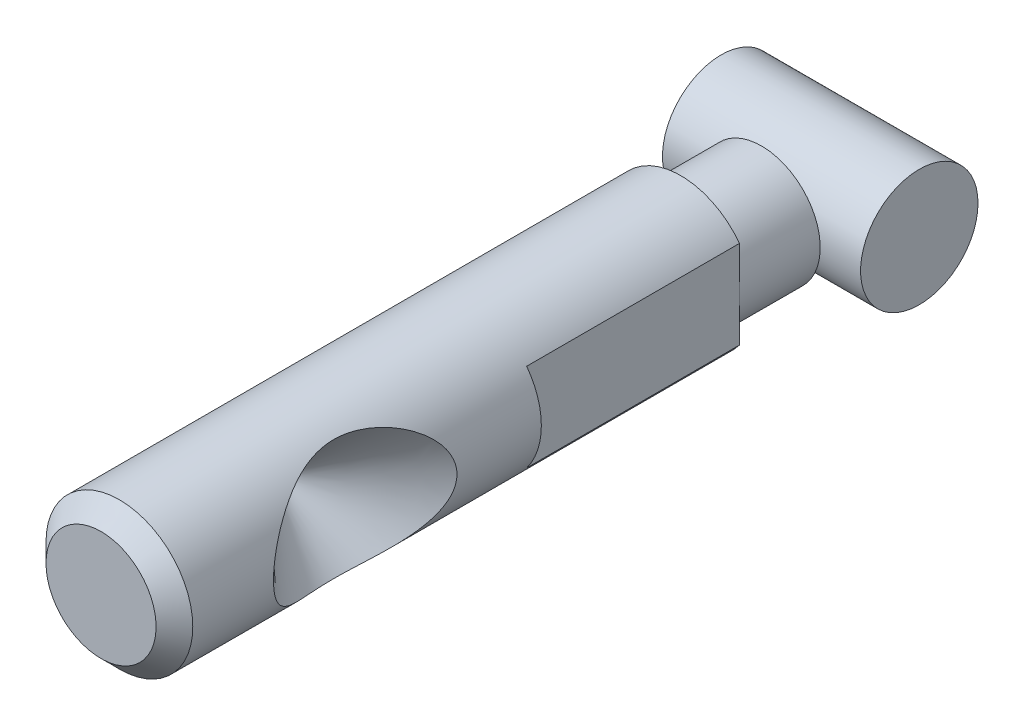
ISO-10303-21;
HEADER;
FILE_DESCRIPTION(('STEP AP214'),'2;1');
FILE_NAME('part.step','',(''),(''),'','','');
FILE_SCHEMA(('AUTOMOTIVE_DESIGN { 1 0 10303 214 1 1 1 1 }'));
ENDSEC;
DATA;
#1=APPLICATION_CONTEXT('core data for automotive mechanical design processes');
#2=APPLICATION_PROTOCOL_DEFINITION('international standard','automotive_design',2000,#1);
#3=PRODUCT_CONTEXT('',#1,'mechanical');
#4=PRODUCT('Part','Part','',(#3));
#5=PRODUCT_RELATED_PRODUCT_CATEGORY('part','',(#4));
#6=PRODUCT_DEFINITION_FORMATION('','',#4);
#7=PRODUCT_DEFINITION_CONTEXT('part definition',#1,'design');
#8=PRODUCT_DEFINITION('design','',#6,#7);
#9=PRODUCT_DEFINITION_SHAPE('','',#8);
#10=(LENGTH_UNIT() NAMED_UNIT(*) SI_UNIT(.MILLI.,.METRE.));
#11=(NAMED_UNIT(*) PLANE_ANGLE_UNIT() SI_UNIT($,.RADIAN.));
#12=(NAMED_UNIT(*) SI_UNIT($,.STERADIAN.) SOLID_ANGLE_UNIT());
#13=UNCERTAINTY_MEASURE_WITH_UNIT(LENGTH_MEASURE(1.E-05),#10,'distance_accuracy_value','');
#14=(GEOMETRIC_REPRESENTATION_CONTEXT(3) GLOBAL_UNCERTAINTY_ASSIGNED_CONTEXT((#13)) GLOBAL_UNIT_ASSIGNED_CONTEXT((#10,
#11,#12)) REPRESENTATION_CONTEXT('',''));
#15=CARTESIAN_POINT('',(0.,0.,0.));
#16=DIRECTION('',(0.,0.,1.));
#17=DIRECTION('',(1.,0.,0.));
#18=AXIS2_PLACEMENT_3D('',#15,#16,#17);
#19=CARTESIAN_POINT('',(-4.,3.,4.));
#20=DIRECTION('',(1.,0.,0.));
#21=DIRECTION('',(0.,0.,-1.));
#22=AXIS2_PLACEMENT_3D('',#19,#20,#21);
#23=PLANE('',#22);
#24=DIRECTION('',(0.,-1.,0.));
#25=VECTOR('',#24,1.);
#26=CARTESIAN_POINT('',(-4.,0.,9.5));
#27=LINE('',#26,#25);
#28=CARTESIAN_POINT('',(-4.,3.,9.5));
#29=VERTEX_POINT('',#28);
#30=CARTESIAN_POINT('',(-4.,0.,9.5));
#31=VERTEX_POINT('',#30);
#32=EDGE_CURVE('P0_E89',#29,#31,#27,.T.);
#33=ORIENTED_EDGE('',*,*,#32,.T.);
#34=DIRECTION('',(0.,1.,0.));
#35=VECTOR('',#34,1.);
#36=CARTESIAN_POINT('',(-4.,0.,9.5));
#37=LINE('',#36,#35);
#38=CARTESIAN_POINT('',(-4.,-3.,9.5));
#39=VERTEX_POINT('',#38);
#40=EDGE_CURVE('P0_E101',#39,#31,#37,.T.);
#41=ORIENTED_EDGE('',*,*,#40,.F.);
#42=DIRECTION('',(0.,0.,1.));
#43=VECTOR('',#42,1.);
#44=CARTESIAN_POINT('',(-4.,-3.,4.));
#45=LINE('',#44,#43);
#46=CARTESIAN_POINT('',(-4.,-3.,24.));
#47=VERTEX_POINT('',#46);
#48=EDGE_CURVE('P0_E11',#47,#39,#45,.F.);
#49=ORIENTED_EDGE('',*,*,#48,.F.);
#50=DIRECTION('',(0.,1.,0.));
#51=VECTOR('',#50,1.);
#52=CARTESIAN_POINT('',(-4.,3.,24.));
#53=LINE('',#52,#51);
#54=CARTESIAN_POINT('',(-4.,3.,24.));
#55=VERTEX_POINT('',#54);
#56=EDGE_CURVE('P0_E123',#55,#47,#53,.F.);
#57=ORIENTED_EDGE('',*,*,#56,.F.);
#58=DIRECTION('',(0.,0.,1.));
#59=VECTOR('',#58,1.);
#60=CARTESIAN_POINT('',(-4.,3.,4.));
#61=LINE('',#60,#59);
#62=EDGE_CURVE('P0_E103',#29,#55,#61,.T.);
#63=ORIENTED_EDGE('',*,*,#62,.F.);
#64=EDGE_LOOP('',(#33,#41,#49,#57,#63));
#65=FACE_BOUND('',#64,.T.);
#66=ADVANCED_FACE('P0_F35',(#65),#23,.F.);
#67=CARTESIAN_POINT('',(0.,0.,4.));
#68=DIRECTION('',(0.,0.,1.));
#69=DIRECTION('',(1.,0.,0.));
#70=AXIS2_PLACEMENT_3D('',#67,#68,#69);
#71=CYLINDRICAL_SURFACE('',#70,5.);
#72=CARTESIAN_POINT('',(5.,0.,42.25));
#73=CARTESIAN_POINT('',(4.99999995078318,0.0804821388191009,42.2499999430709));
#74=CARTESIAN_POINT('',(4.99805116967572,0.160970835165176,42.2464932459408));
#75=CARTESIAN_POINT('',(4.9903177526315,0.321197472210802,42.2325640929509));
#76=CARTESIAN_POINT('',(4.98453097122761,0.400934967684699,42.2221377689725));
#77=CARTESIAN_POINT('',(4.96928487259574,0.559039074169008,42.1946242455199));
#78=CARTESIAN_POINT('',(4.95981901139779,0.637402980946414,42.1775251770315));
#79=CARTESIAN_POINT('',(4.93749012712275,0.792027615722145,42.137100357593));
#80=CARTESIAN_POINT('',(4.92462530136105,0.868287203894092,42.1137713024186));
#81=CARTESIAN_POINT('',(4.88172535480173,1.09156138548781,42.0357573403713));
#82=CARTESIAN_POINT('',(4.84719920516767,1.23486744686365,41.9727140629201));
#83=CARTESIAN_POINT('',(4.76896944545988,1.50908965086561,41.8286520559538));
#84=CARTESIAN_POINT('',(4.72526408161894,1.64000341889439,41.7476298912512));
#85=CARTESIAN_POINT('',(4.60352286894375,1.96276178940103,41.5194736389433));
#86=CARTESIAN_POINT('',(4.52043634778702,2.14503620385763,41.3615210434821));
#87=CARTESIAN_POINT('',(4.34566033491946,2.48014816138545,41.0209557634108));
#88=CARTESIAN_POINT('',(4.25394623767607,2.63289746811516,40.8382718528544));
#89=CARTESIAN_POINT('',(4.08895805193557,2.8804881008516,40.4984090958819));
#90=CARTESIAN_POINT('',(4.01618819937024,2.98062092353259,40.3447653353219));
#91=CARTESIAN_POINT('',(3.87132811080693,3.16649925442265,40.0286096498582));
#92=CARTESIAN_POINT('',(3.79923826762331,3.25223687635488,39.8660929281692));
#93=CARTESIAN_POINT('',(3.65777928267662,3.41056202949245,39.5331846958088));
#94=CARTESIAN_POINT('',(3.58841628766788,3.48312105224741,39.3627770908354));
#95=CARTESIAN_POINT('',(3.45478262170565,3.61570625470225,39.0152552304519));
#96=CARTESIAN_POINT('',(3.39051129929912,3.67573403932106,38.8381418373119));
#97=CARTESIAN_POINT('',(3.26707344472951,3.78593971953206,38.4707968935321));
#98=CARTESIAN_POINT('',(3.20820232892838,3.83564421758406,38.2803230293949));
#99=CARTESIAN_POINT('',(3.10141543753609,3.92249497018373,37.8934811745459));
#100=CARTESIAN_POINT('',(3.05350002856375,3.95964080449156,37.6971129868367));
#101=CARTESIAN_POINT('',(2.97181377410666,4.02131111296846,37.3004498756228));
#102=CARTESIAN_POINT('',(2.93797707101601,4.04589447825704,37.1001779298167));
#103=CARTESIAN_POINT('',(2.88672337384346,4.08262720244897,36.6964224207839));
#104=CARTESIAN_POINT('',(2.86930136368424,4.09478035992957,36.4929398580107));
#105=CARTESIAN_POINT('',(2.85315694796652,4.10604116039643,36.1034562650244));
#106=CARTESIAN_POINT('',(2.85287645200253,4.10623579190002,35.917550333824));
#107=CARTESIAN_POINT('',(2.86713586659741,4.09629181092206,35.5465919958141));
#108=CARTESIAN_POINT('',(2.88167583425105,4.08615315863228,35.3615395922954));
#109=CARTESIAN_POINT('',(2.92458383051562,4.05555112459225,34.9932851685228));
#110=CARTESIAN_POINT('',(2.95299968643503,4.03505202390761,34.8100918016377));
#111=CARTESIAN_POINT('',(3.02182126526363,3.98377049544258,34.4474502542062));
#112=CARTESIAN_POINT('',(3.06222884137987,3.95298647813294,34.2680026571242));
#113=CARTESIAN_POINT('',(3.15931599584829,3.87596283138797,33.888362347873));
#114=CARTESIAN_POINT('',(3.21749673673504,3.82814176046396,33.6888762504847));
#115=CARTESIAN_POINT('',(3.34335337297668,3.71872817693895,33.2967684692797));
#116=CARTESIAN_POINT('',(3.41103217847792,3.6571314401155,33.1041489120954));
#117=CARTESIAN_POINT('',(3.55279023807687,3.51957932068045,32.7266730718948));
#118=CARTESIAN_POINT('',(3.62686587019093,3.44363203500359,32.5418124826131));
#119=CARTESIAN_POINT('',(3.77861956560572,3.2763966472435,32.1808352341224));
#120=CARTESIAN_POINT('',(3.85629570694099,3.185116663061,32.0047140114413));
#121=CARTESIAN_POINT('',(4.03419752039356,2.95828389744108,31.6153374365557));
#122=CARTESIAN_POINT('',(4.13473370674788,2.81746399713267,31.4052377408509));
#123=CARTESIAN_POINT('',(4.33119418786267,2.50494757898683,31.0070873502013));
#124=CARTESIAN_POINT('',(4.42712788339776,2.33331771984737,30.8189904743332));
#125=CARTESIAN_POINT('',(4.58008447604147,2.01110116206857,30.525165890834));
#126=CARTESIAN_POINT('',(4.64022997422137,1.86927657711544,30.4115204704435));
#127=CARTESIAN_POINT('',(4.75064028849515,1.56751785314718,30.2051039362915));
#128=CARTESIAN_POINT('',(4.80091707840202,1.40760603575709,30.1123075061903));
#129=CARTESIAN_POINT('',(4.87748006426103,1.10836436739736,29.9719528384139));
#130=CARTESIAN_POINT('',(4.90661429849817,0.972345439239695,29.9189251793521));
#131=CARTESIAN_POINT('',(4.95385494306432,0.692330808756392,29.8332156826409));
#132=CARTESIAN_POINT('',(4.97198888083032,0.548356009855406,29.8004830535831));
#133=CARTESIAN_POINT('',(4.98915480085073,0.335888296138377,29.7695307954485));
#134=CARTESIAN_POINT('',(4.99321122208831,0.269008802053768,29.7622238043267));
#135=CARTESIAN_POINT('',(4.99863421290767,0.134754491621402,29.7524577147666));
#136=CARTESIAN_POINT('',(5.00000004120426,0.0673795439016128,29.749999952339));
#137=CARTESIAN_POINT('',(4.99999995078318,-0.0804821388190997,29.7500000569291));
#138=CARTESIAN_POINT('',(4.99805116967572,-0.160970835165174,29.7535067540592));
#139=CARTESIAN_POINT('',(4.9903177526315,-0.321197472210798,29.7674359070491));
#140=CARTESIAN_POINT('',(4.98453097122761,-0.400934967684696,29.7778622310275));
#141=CARTESIAN_POINT('',(4.96928487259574,-0.559039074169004,29.8053757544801));
#142=CARTESIAN_POINT('',(4.95981901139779,-0.63740298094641,29.8224748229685));
#143=CARTESIAN_POINT('',(4.93749012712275,-0.792027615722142,29.862899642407));
#144=CARTESIAN_POINT('',(4.92462530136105,-0.868287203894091,29.8862286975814));
#145=CARTESIAN_POINT('',(4.88172535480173,-1.0915613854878,29.9642426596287));
#146=CARTESIAN_POINT('',(4.84719920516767,-1.23486744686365,30.0272859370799));
#147=CARTESIAN_POINT('',(4.76896944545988,-1.50908965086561,30.1713479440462));
#148=CARTESIAN_POINT('',(4.72526408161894,-1.64000341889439,30.2523701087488));
#149=CARTESIAN_POINT('',(4.60352286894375,-1.96276178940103,30.4805263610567));
#150=CARTESIAN_POINT('',(4.52043634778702,-2.14503620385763,30.6384789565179));
#151=CARTESIAN_POINT('',(4.34566033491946,-2.48014816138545,30.9790442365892));
#152=CARTESIAN_POINT('',(4.25394623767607,-2.63289746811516,31.1617281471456));
#153=CARTESIAN_POINT('',(4.08895805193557,-2.8804881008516,31.5015909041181));
#154=CARTESIAN_POINT('',(4.01618819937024,-2.98062092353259,31.6552346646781));
#155=CARTESIAN_POINT('',(3.87132811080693,-3.16649925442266,31.9713903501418));
#156=CARTESIAN_POINT('',(3.79923826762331,-3.25223687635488,32.1339070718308));
#157=CARTESIAN_POINT('',(3.65777928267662,-3.41056202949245,32.4668153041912));
#158=CARTESIAN_POINT('',(3.58841628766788,-3.48312105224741,32.6372229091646));
#159=CARTESIAN_POINT('',(3.45478262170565,-3.61570625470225,32.9847447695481));
#160=CARTESIAN_POINT('',(3.39051129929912,-3.67573403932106,33.1618581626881));
#161=CARTESIAN_POINT('',(3.26707344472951,-3.78593971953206,33.5292031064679));
#162=CARTESIAN_POINT('',(3.20820232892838,-3.83564421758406,33.7196769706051));
#163=CARTESIAN_POINT('',(3.10141543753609,-3.92249497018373,34.1065188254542));
#164=CARTESIAN_POINT('',(3.05350002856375,-3.95964080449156,34.3028870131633));
#165=CARTESIAN_POINT('',(2.97181377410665,-4.02131111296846,34.6995501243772));
#166=CARTESIAN_POINT('',(2.937977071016,-4.04589447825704,34.8998220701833));
#167=CARTESIAN_POINT('',(2.88672337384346,-4.08262720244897,35.3035775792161));
#168=CARTESIAN_POINT('',(2.86930136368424,-4.09478035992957,35.5070601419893));
#169=CARTESIAN_POINT('',(2.85315694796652,-4.10604116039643,35.8965437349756));
#170=CARTESIAN_POINT('',(2.85287645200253,-4.10623579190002,36.082449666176));
#171=CARTESIAN_POINT('',(2.86713586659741,-4.09629181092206,36.453408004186));
#172=CARTESIAN_POINT('',(2.88167583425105,-4.08615315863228,36.6384604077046));
#173=CARTESIAN_POINT('',(2.92458383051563,-4.05555112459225,37.0067148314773));
#174=CARTESIAN_POINT('',(2.95299968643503,-4.03505202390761,37.1899081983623));
#175=CARTESIAN_POINT('',(3.02182126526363,-3.98377049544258,37.5525497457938));
#176=CARTESIAN_POINT('',(3.06222884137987,-3.95298647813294,37.7319973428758));
#177=CARTESIAN_POINT('',(3.15931599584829,-3.87596283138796,38.111637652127));
#178=CARTESIAN_POINT('',(3.21749673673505,-3.82814176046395,38.3111237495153));
#179=CARTESIAN_POINT('',(3.34335337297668,-3.71872817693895,38.7032315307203));
#180=CARTESIAN_POINT('',(3.41103217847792,-3.6571314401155,38.8958510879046));
#181=CARTESIAN_POINT('',(3.55279023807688,-3.51957932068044,39.2733269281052));
#182=CARTESIAN_POINT('',(3.62686587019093,-3.44363203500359,39.4581875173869));
#183=CARTESIAN_POINT('',(3.77861956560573,-3.27639664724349,39.8191647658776));
#184=CARTESIAN_POINT('',(3.856295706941,-3.18511666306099,39.9952859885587));
#185=CARTESIAN_POINT('',(4.03419752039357,-2.95828389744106,40.3846625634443));
#186=CARTESIAN_POINT('',(4.13473370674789,-2.81746399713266,40.5947622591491));
#187=CARTESIAN_POINT('',(4.33119418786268,-2.50494757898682,40.9929126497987));
#188=CARTESIAN_POINT('',(4.42712788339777,-2.33331771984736,41.1810095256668));
#189=CARTESIAN_POINT('',(4.58008447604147,-2.01110116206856,41.474834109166));
#190=CARTESIAN_POINT('',(4.64022997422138,-1.86927657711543,41.5884795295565));
#191=CARTESIAN_POINT('',(4.75064028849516,-1.56751785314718,41.7948960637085));
#192=CARTESIAN_POINT('',(4.80091707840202,-1.40760603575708,41.8876924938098));
#193=CARTESIAN_POINT('',(4.87748006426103,-1.10836436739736,42.0280471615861));
#194=CARTESIAN_POINT('',(4.90661429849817,-0.972345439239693,42.081074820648));
#195=CARTESIAN_POINT('',(4.95385494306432,-0.69233080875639,42.1667843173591));
#196=CARTESIAN_POINT('',(4.97198888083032,-0.548356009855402,42.1995169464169));
#197=CARTESIAN_POINT('',(4.98915480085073,-0.335888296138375,42.2304692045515));
#198=CARTESIAN_POINT('',(4.99321122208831,-0.269008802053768,42.2377761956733));
#199=CARTESIAN_POINT('',(4.99863421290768,-0.134754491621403,42.2475422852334));
#200=CARTESIAN_POINT('',(5.00000004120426,-0.0673795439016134,42.250000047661));
#201=CARTESIAN_POINT('',(5.,0.,42.25));
#202=B_SPLINE_CURVE_WITH_KNOTS('',3,(#72,#73,#74,#75,#76,#77,#78,#79,#80,#81,#82,#83,#84,#85,
#86,#87,#88,#89,#90,#91,#92,#93,#94,#95,#96,#97,#98,#99,#100,#101,#102,#103,#104,#105,#106,#107,
#108,#109,#110,#111,#112,#113,#114,#115,#116,#117,#118,#119,#120,#121,#122,#123,#124,#125,#126,
#127,#128,#129,#130,#131,#132,#133,#134,#135,#136,#137,#138,#139,#140,#141,#142,#143,#144,#145,
#146,#147,#148,#149,#150,#151,#152,#153,#154,#155,#156,#157,#158,#159,#160,#161,#162,#163,#164,
#165,#166,#167,#168,#169,#170,#171,#172,#173,#174,#175,#176,#177,#178,#179,#180,#181,#182,#183,
#184,#185,#186,#187,#188,#189,#190,#191,#192,#193,#194,#195,#196,#197,#198,#199,#200,#201),
.UNSPECIFIED.,.T.,.F.,(4,2,2,2,2,2,2,2,2,2,2,2,2,2,2,2,2,2,2,2,2,2,2,2,2,2,2,2,2,2,2,2,2,2,2,2,
2,2,2,2,2,2,2,2,2,2,2,2,2,2,2,2,2,2,2,2,2,2,2,2,2,2,2,2,4),(0.,0.241359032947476,
0.482853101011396,0.724778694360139,0.966832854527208,1.44551051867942,1.92427972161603,
2.68525794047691,3.44847633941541,4.03962984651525,4.63110616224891,5.22384712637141,
5.81651212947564,6.43220739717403,7.04792326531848,7.66072563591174,8.27334068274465,
8.83018022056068,9.38702190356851,9.94579659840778,10.5046576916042,11.1435024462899,
11.7825433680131,12.4212247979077,13.0595691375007,13.8739739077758,14.6866374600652,
15.2592235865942,15.8311106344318,16.2760498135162,16.7198709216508,16.9218807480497,
17.1239462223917,17.3653052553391,17.6067993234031,17.8487249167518,18.0907790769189,
18.5694567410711,19.0482259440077,19.8092041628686,20.5724225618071,21.1635760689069,
21.7550523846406,22.3477933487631,22.9404583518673,23.5561536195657,24.1718694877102,
24.7846718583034,25.3972869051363,25.9541264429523,26.5109681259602,27.0697428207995,
27.6286039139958,28.2674486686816,28.9064895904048,29.5451710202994,30.1835153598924,
30.9979201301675,31.8105836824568,32.3831698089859,32.9550568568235,33.3999960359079,
33.8438171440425,34.0458269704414,34.2478924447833),.UNSPECIFIED.);
#203=CARTESIAN_POINT('',(5.,0.,42.25));
#204=VERTEX_POINT('',#203);
#205=EDGE_CURVE('P0_E122',#204,#204,#202,.T.);
#206=ORIENTED_EDGE('',*,*,#205,.T.);
#207=EDGE_LOOP('',(#206));
#208=FACE_BOUND('',#207,.T.);
#209=CARTESIAN_POINT('',(0.,0.,47.75));
#210=DIRECTION('',(0.,0.,1.));
#211=DIRECTION('',(1.,0.,0.));
#212=AXIS2_PLACEMENT_3D('',#209,#210,#211);
#213=CIRCLE('',#212,5.);
#214=CARTESIAN_POINT('',(5.,0.,47.75));
#215=VERTEX_POINT('',#214);
#216=EDGE_CURVE('P0_E119',#215,#215,#213,.F.);
#217=ORIENTED_EDGE('',*,*,#216,.T.);
#218=EDGE_LOOP('',(#217));
#219=FACE_BOUND('',#218,.T.);
#220=DIRECTION('',(0.,0.,1.));
#221=VECTOR('',#220,1.);
#222=CARTESIAN_POINT('',(4.,3.,4.));
#223=LINE('',#222,#221);
#224=CARTESIAN_POINT('',(4.,3.,24.));
#225=VERTEX_POINT('',#224);
#226=CARTESIAN_POINT('',(4.,3.,9.5));
#227=VERTEX_POINT('',#226);
#228=EDGE_CURVE('P0_E132',#225,#227,#223,.F.);
#229=ORIENTED_EDGE('',*,*,#228,.T.);
#230=CARTESIAN_POINT('',(0.,0.,9.5));
#231=DIRECTION('',(0.,0.,1.));
#232=DIRECTION('',(-1.,0.,0.));
#233=AXIS2_PLACEMENT_3D('',#230,#231,#232);
#234=CIRCLE('',#233,5.);
#235=EDGE_CURVE('P0_E104',#227,#29,#234,.T.);
#236=ORIENTED_EDGE('',*,*,#235,.T.);
#237=ORIENTED_EDGE('',*,*,#62,.T.);
#238=CARTESIAN_POINT('',(0.,0.,24.));
#239=DIRECTION('',(0.,0.,1.));
#240=DIRECTION('',(1.,0.,0.));
#241=AXIS2_PLACEMENT_3D('',#238,#239,#240);
#242=CIRCLE('',#241,5.);
#243=EDGE_CURVE('P0_E44',#55,#47,#242,.T.);
#244=ORIENTED_EDGE('',*,*,#243,.T.);
#245=ORIENTED_EDGE('',*,*,#48,.T.);
#246=CARTESIAN_POINT('',(0.,0.,9.5));
#247=DIRECTION('',(0.,0.,-1.));
#248=DIRECTION('',(-1.,0.,0.));
#249=AXIS2_PLACEMENT_3D('',#246,#247,#248);
#250=CIRCLE('',#249,5.);
#251=CARTESIAN_POINT('',(4.,-3.,9.5));
#252=VERTEX_POINT('',#251);
#253=EDGE_CURVE('P0_E111',#252,#39,#250,.T.);
#254=ORIENTED_EDGE('',*,*,#253,.F.);
#255=DIRECTION('',(0.,0.,1.));
#256=VECTOR('',#255,1.);
#257=CARTESIAN_POINT('',(4.,-3.,4.));
#258=LINE('',#257,#256);
#259=CARTESIAN_POINT('',(4.,-3.,24.));
#260=VERTEX_POINT('',#259);
#261=EDGE_CURVE('P0_E126',#252,#260,#258,.T.);
#262=ORIENTED_EDGE('',*,*,#261,.T.);
#263=CARTESIAN_POINT('',(0.,0.,24.));
#264=DIRECTION('',(0.,0.,1.));
#265=DIRECTION('',(1.,0.,0.));
#266=AXIS2_PLACEMENT_3D('',#263,#264,#265);
#267=CIRCLE('',#266,5.);
#268=EDGE_CURVE('P0_E128',#260,#225,#267,.T.);
#269=ORIENTED_EDGE('',*,*,#268,.T.);
#270=EDGE_LOOP('',(#229,#236,#237,#244,#245,#254,#262,#269));
#271=FACE_BOUND('',#270,.T.);
#272=ADVANCED_FACE('P0_F154',(#208,#219,#271),#71,.T.);
#273=CARTESIAN_POINT('',(4.,-3.,4.));
#274=DIRECTION('',(-1.,0.,0.));
#275=DIRECTION('',(0.,0.,1.));
#276=AXIS2_PLACEMENT_3D('',#273,#274,#275);
#277=PLANE('',#276);
#278=DIRECTION('',(0.,1.,0.));
#279=VECTOR('',#278,1.);
#280=CARTESIAN_POINT('',(4.,0.,9.5));
#281=LINE('',#280,#279);
#282=CARTESIAN_POINT('',(4.,0.,9.5));
#283=VERTEX_POINT('',#282);
#284=EDGE_CURVE('P0_E92',#283,#227,#281,.T.);
#285=ORIENTED_EDGE('',*,*,#284,.T.);
#286=ORIENTED_EDGE('',*,*,#228,.F.);
#287=DIRECTION('',(0.,1.,0.));
#288=VECTOR('',#287,1.);
#289=CARTESIAN_POINT('',(4.,-3.,24.));
#290=LINE('',#289,#288);
#291=EDGE_CURVE('P0_E130',#260,#225,#290,.T.);
#292=ORIENTED_EDGE('',*,*,#291,.F.);
#293=ORIENTED_EDGE('',*,*,#261,.F.);
#294=DIRECTION('',(0.,-1.,0.));
#295=VECTOR('',#294,1.);
#296=CARTESIAN_POINT('',(4.,0.,9.5));
#297=LINE('',#296,#295);
#298=EDGE_CURVE('P0_E52',#283,#252,#297,.T.);
#299=ORIENTED_EDGE('',*,*,#298,.F.);
#300=EDGE_LOOP('',(#285,#286,#292,#293,#299));
#301=FACE_BOUND('',#300,.T.);
#302=ADVANCED_FACE('P0_F159',(#301),#277,.F.);
#303=CARTESIAN_POINT('',(0.,0.,4.));
#304=DIRECTION('',(0.,0.,-1.));
#305=DIRECTION('',(-1.,0.,0.));
#306=AXIS2_PLACEMENT_3D('',#303,#304,#305);
#307=PLANE('',#306);
#308=CARTESIAN_POINT('',(0.,0.,4.));
#309=DIRECTION('',(0.,0.,-1.));
#310=DIRECTION('',(-1.,0.,0.));
#311=AXIS2_PLACEMENT_3D('',#308,#309,#310);
#312=CIRCLE('',#311,4.);
#313=CARTESIAN_POINT('',(-4.,0.,4.));
#314=VERTEX_POINT('',#313);
#315=EDGE_CURVE('P0_E108',#314,#314,#312,.T.);
#316=ORIENTED_EDGE('',*,*,#315,.T.);
#317=EDGE_LOOP('',(#316));
#318=FACE_BOUND('',#317,.T.);
#319=ADVANCED_FACE('P0_F162',(#318),#307,.T.);
#320=CARTESIAN_POINT('',(-1.24999999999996,0.,21.6164430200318));
#321=DIRECTION('',(1.,0.,0.));
#322=DIRECTION('',(0.,1.,0.));
#323=AXIS2_PLACEMENT_3D('',#320,#321,#322);
#324=PLANE('',#323);
#325=CARTESIAN_POINT('',(-1.25,0.,36.));
#326=DIRECTION('',(1.,0.,0.));
#327=DIRECTION('',(0.,0.,-1.));
#328=AXIS2_PLACEMENT_3D('',#325,#326,#327);
#329=CIRCLE('',#328,0.0499999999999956);
#330=CARTESIAN_POINT('',(-1.25,0.,35.95));
#331=VERTEX_POINT('',#330);
#332=EDGE_CURVE('P0_E58',#331,#331,#329,.T.);
#333=ORIENTED_EDGE('',*,*,#332,.T.);
#334=EDGE_LOOP('',(#333));
#335=FACE_BOUND('',#334,.T.);
#336=ADVANCED_FACE('P0_F37',(#335),#324,.T.);
#337=CARTESIAN_POINT('',(0.,0.,49.));
#338=DIRECTION('',(0.,0.,-1.));
#339=DIRECTION('',(-1.,0.,0.));
#340=AXIS2_PLACEMENT_3D('',#337,#338,#339);
#341=PLANE('',#340);
#342=CARTESIAN_POINT('',(0.,0.,49.0000000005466));
#343=DIRECTION('',(0.,0.,-1.));
#344=DIRECTION('',(-1.,0.,0.));
#345=AXIS2_PLACEMENT_3D('',#342,#343,#344);
#346=CIRCLE('',#345,3.7500000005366);
#347=CARTESIAN_POINT('',(-3.7500000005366,0.,49.0000000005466));
#348=VERTEX_POINT('',#347);
#349=EDGE_CURVE('P0_E39',#348,#348,#346,.T.);
#350=ORIENTED_EDGE('',*,*,#349,.F.);
#351=EDGE_LOOP('',(#350));
#352=FACE_BOUND('',#351,.T.);
#353=ADVANCED_FACE('P0_F183',(#352),#341,.F.);
#354=CARTESIAN_POINT('',(-1.2,0.,36.));
#355=DIRECTION('',(-1.,0.,0.));
#356=DIRECTION('',(0.,0.,1.));
#357=AXIS2_PLACEMENT_3D('',#354,#355,#356);
#358=CYLINDRICAL_SURFACE('',#357,0.0499999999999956);
#359=ORIENTED_EDGE('',*,*,#332,.F.);
#360=EDGE_LOOP('',(#359));
#361=FACE_BOUND('',#360,.T.);
#362=CARTESIAN_POINT('',(-1.2,0.,36.));
#363=DIRECTION('',(1.,0.,0.));
#364=DIRECTION('',(0.,0.,-1.));
#365=AXIS2_PLACEMENT_3D('',#362,#363,#364);
#366=CIRCLE('',#365,0.0499999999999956);
#367=CARTESIAN_POINT('',(-1.2,0.,35.95));
#368=VERTEX_POINT('',#367);
#369=EDGE_CURVE('P0_E136',#368,#368,#366,.T.);
#370=ORIENTED_EDGE('',*,*,#369,.T.);
#371=EDGE_LOOP('',(#370));
#372=FACE_BOUND('',#371,.T.);
#373=ADVANCED_FACE('P0_F181',(#361,#372),#358,.F.);
#374=CARTESIAN_POINT('',(0.,0.,47.7499999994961));
#375=DIRECTION('',(0.,0.,-1.));
#376=DIRECTION('',(-1.,0.,0.));
#377=AXIS2_PLACEMENT_3D('',#374,#375,#376);
#378=CONICAL_SURFACE('',#377,4.99999999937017,0.785398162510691);
#379=ORIENTED_EDGE('',*,*,#216,.F.);
#380=EDGE_LOOP('',(#379));
#381=FACE_BOUND('',#380,.T.);
#382=ORIENTED_EDGE('',*,*,#349,.T.);
#383=EDGE_LOOP('',(#382));
#384=FACE_BOUND('',#383,.T.);
#385=ADVANCED_FACE('P0_F179',(#381,#384),#378,.T.);
#386=CARTESIAN_POINT('',(5.,0.,36.));
#387=DIRECTION('',(1.,0.,0.));
#388=DIRECTION('',(0.,1.,0.));
#389=AXIS2_PLACEMENT_3D('',#386,#387,#388);
#390=CONICAL_SURFACE('',#389,6.25,0.785398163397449);
#391=ORIENTED_EDGE('',*,*,#369,.F.);
#392=EDGE_LOOP('',(#391));
#393=FACE_BOUND('',#392,.T.);
#394=ORIENTED_EDGE('',*,*,#205,.F.);
#395=EDGE_LOOP('',(#394));
#396=FACE_BOUND('',#395,.T.);
#397=ADVANCED_FACE('P0_F151',(#393,#396),#390,.F.);
#398=CARTESIAN_POINT('',(4.3341995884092,0.,24.));
#399=DIRECTION('',(0.,0.,1.));
#400=DIRECTION('',(1.,0.,0.));
#401=AXIS2_PLACEMENT_3D('',#398,#399,#400);
#402=PLANE('',#401);
#403=ORIENTED_EDGE('',*,*,#268,.F.);
#404=ORIENTED_EDGE('',*,*,#291,.T.);
#405=EDGE_LOOP('',(#403,#404));
#406=FACE_BOUND('',#405,.T.);
#407=ADVANCED_FACE('P0_F171',(#406),#402,.F.);
#408=CARTESIAN_POINT('',(-4.3341995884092,0.,24.));
#409=DIRECTION('',(0.,0.,1.));
#410=DIRECTION('',(1.,0.,0.));
#411=AXIS2_PLACEMENT_3D('',#408,#409,#410);
#412=PLANE('',#411);
#413=ORIENTED_EDGE('',*,*,#243,.F.);
#414=ORIENTED_EDGE('',*,*,#56,.T.);
#415=EDGE_LOOP('',(#413,#414));
#416=FACE_BOUND('',#415,.T.);
#417=ADVANCED_FACE('P0_F166',(#416),#412,.F.);
#418=CARTESIAN_POINT('',(0.,0.,9.5));
#419=DIRECTION('',(0.,0.,-1.));
#420=DIRECTION('',(-1.,0.,0.));
#421=AXIS2_PLACEMENT_3D('',#418,#419,#420);
#422=CYLINDRICAL_SURFACE('',#421,4.);
#423=ORIENTED_EDGE('',*,*,#315,.F.);
#424=EDGE_LOOP('',(#423));
#425=FACE_BOUND('',#424,.T.);
#426=CARTESIAN_POINT('',(0.,0.,9.5));
#427=DIRECTION('',(0.,0.,1.));
#428=DIRECTION('',(-1.,0.,0.));
#429=AXIS2_PLACEMENT_3D('',#426,#427,#428);
#430=CIRCLE('',#429,4.);
#431=EDGE_CURVE('P0_E86',#283,#31,#430,.T.);
#432=ORIENTED_EDGE('',*,*,#431,.F.);
#433=CARTESIAN_POINT('',(0.,0.,9.5));
#434=DIRECTION('',(0.,0.,-1.));
#435=DIRECTION('',(-1.,0.,0.));
#436=AXIS2_PLACEMENT_3D('',#433,#434,#435);
#437=CIRCLE('',#436,4.);
#438=EDGE_CURVE('P0_E106',#283,#31,#437,.T.);
#439=ORIENTED_EDGE('',*,*,#438,.T.);
#440=EDGE_LOOP('',(#432,#439));
#441=FACE_BOUND('',#440,.T.);
#442=ADVANCED_FACE('P0_F107',(#425,#441),#422,.T.);
#443=CARTESIAN_POINT('',(0.,0.,9.5));
#444=DIRECTION('',(0.,0.,-1.));
#445=DIRECTION('',(-1.,0.,0.));
#446=AXIS2_PLACEMENT_3D('',#443,#444,#445);
#447=PLANE('',#446);
#448=ORIENTED_EDGE('',*,*,#438,.F.);
#449=ORIENTED_EDGE('',*,*,#298,.T.);
#450=ORIENTED_EDGE('',*,*,#253,.T.);
#451=ORIENTED_EDGE('',*,*,#40,.T.);
#452=EDGE_LOOP('',(#448,#449,#450,#451));
#453=FACE_BOUND('',#452,.T.);
#454=ADVANCED_FACE('P0_F110',(#453),#447,.T.);
#455=CARTESIAN_POINT('',(0.,0.,9.5));
#456=DIRECTION('',(0.,0.,-1.));
#457=DIRECTION('',(-1.,0.,0.));
#458=AXIS2_PLACEMENT_3D('',#455,#456,#457);
#459=PLANE('',#458);
#460=ORIENTED_EDGE('',*,*,#431,.T.);
#461=ORIENTED_EDGE('',*,*,#32,.F.);
#462=ORIENTED_EDGE('',*,*,#235,.F.);
#463=ORIENTED_EDGE('',*,*,#284,.F.);
#464=EDGE_LOOP('',(#460,#461,#462,#463));
#465=FACE_BOUND('',#464,.T.);
#466=ADVANCED_FACE('P0_F88',(#465),#459,.T.);
#467=CLOSED_SHELL('',(#66,#272,#302,#319,#336,#353,#373,#385,#397,#407,#417,#442,#454,#466));
#468=MANIFOLD_SOLID_BREP('P0_B2',#467);
#469=CARTESIAN_POINT('',(-6.75,0.,0.));
#470=DIRECTION('',(-1.,0.,0.));
#471=DIRECTION('',(0.,0.,1.));
#472=AXIS2_PLACEMENT_3D('',#469,#470,#471);
#473=PLANE('',#472);
#474=CARTESIAN_POINT('',(-6.75,0.,0.));
#475=DIRECTION('',(1.,0.,0.));
#476=DIRECTION('',(0.,0.,-1.));
#477=AXIS2_PLACEMENT_3D('',#474,#475,#476);
#478=CIRCLE('',#477,4.);
#479=CARTESIAN_POINT('',(-6.75,0.,-4.));
#480=VERTEX_POINT('',#479);
#481=EDGE_CURVE('P1_E17',#480,#480,#478,.T.);
#482=ORIENTED_EDGE('',*,*,#481,.F.);
#483=EDGE_LOOP('',(#482));
#484=FACE_BOUND('',#483,.T.);
#485=ADVANCED_FACE('P1_F14',(#484),#473,.T.);
#486=CARTESIAN_POINT('',(6.75,0.,0.));
#487=DIRECTION('',(-1.,0.,0.));
#488=DIRECTION('',(0.,0.,1.));
#489=AXIS2_PLACEMENT_3D('',#486,#487,#488);
#490=PLANE('',#489);
#491=CARTESIAN_POINT('',(6.75,0.,0.));
#492=DIRECTION('',(1.,0.,0.));
#493=DIRECTION('',(0.,0.,-1.));
#494=AXIS2_PLACEMENT_3D('',#491,#492,#493);
#495=CIRCLE('',#494,4.);
#496=CARTESIAN_POINT('',(6.75,0.,-4.));
#497=VERTEX_POINT('',#496);
#498=EDGE_CURVE('P1_E10',#497,#497,#495,.F.);
#499=ORIENTED_EDGE('',*,*,#498,.F.);
#500=EDGE_LOOP('',(#499));
#501=FACE_BOUND('',#500,.T.);
#502=ADVANCED_FACE('P1_F31',(#501),#490,.F.);
#503=CARTESIAN_POINT('',(0.,0.,0.));
#504=DIRECTION('',(1.,0.,0.));
#505=DIRECTION('',(0.,0.,-1.));
#506=AXIS2_PLACEMENT_3D('',#503,#504,#505);
#507=CYLINDRICAL_SURFACE('',#506,4.);
#508=ORIENTED_EDGE('',*,*,#498,.T.);
#509=EDGE_LOOP('',(#508));
#510=FACE_BOUND('',#509,.T.);
#511=ORIENTED_EDGE('',*,*,#481,.T.);
#512=EDGE_LOOP('',(#511));
#513=FACE_BOUND('',#512,.T.);
#514=ADVANCED_FACE('P1_F28',(#510,#513),#507,.T.);
#515=CLOSED_SHELL('',(#485,#502,#514));
#516=MANIFOLD_SOLID_BREP('P1_B1',#515);
#517=ADVANCED_BREP_SHAPE_REPRESENTATION('',(#18,#468,#516),#14);
#518=SHAPE_DEFINITION_REPRESENTATION(#9,#517);
ENDSEC;
END-ISO-10303-21;
